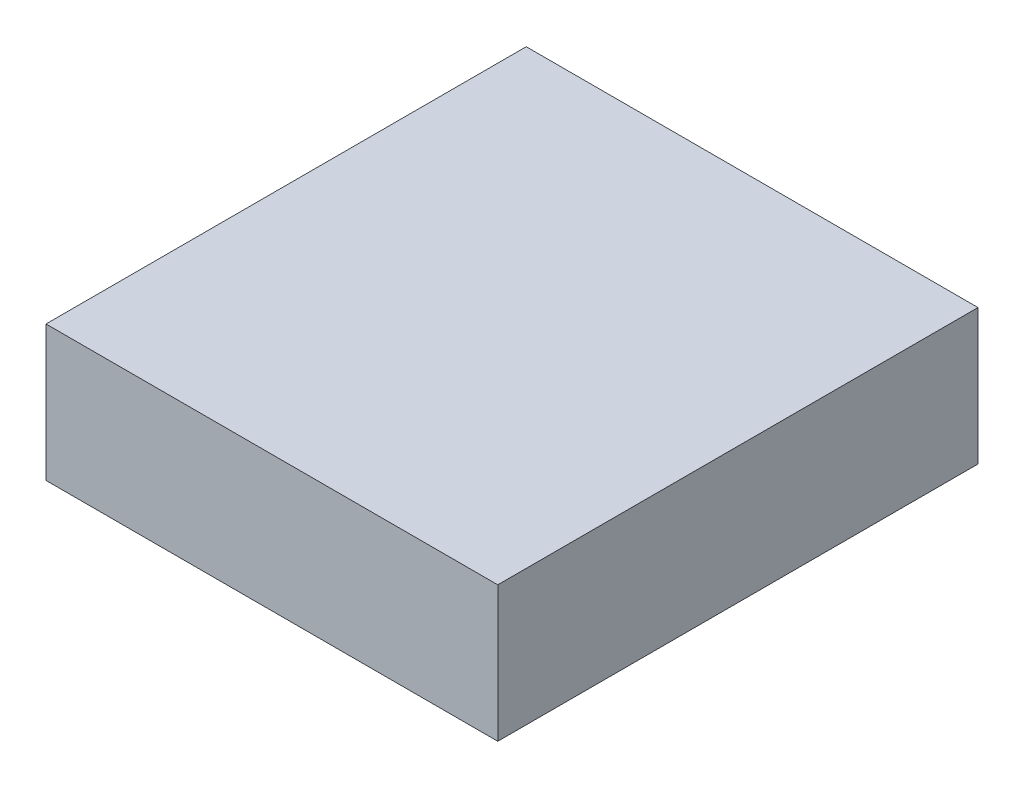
ISO-10303-21;
HEADER;
FILE_DESCRIPTION(('STEP AP214'),'2;1');
FILE_NAME('part.step','',(''),(''),'','','');
FILE_SCHEMA(('AUTOMOTIVE_DESIGN { 1 0 10303 214 1 1 1 1 }'));
ENDSEC;
DATA;
#1=APPLICATION_CONTEXT('core data for automotive mechanical design processes');
#2=APPLICATION_PROTOCOL_DEFINITION('international standard','automotive_design',2000,#1);
#3=PRODUCT_CONTEXT('',#1,'mechanical');
#4=PRODUCT('Part','Part','',(#3));
#5=PRODUCT_RELATED_PRODUCT_CATEGORY('part','',(#4));
#6=PRODUCT_DEFINITION_FORMATION('','',#4);
#7=PRODUCT_DEFINITION_CONTEXT('part definition',#1,'design');
#8=PRODUCT_DEFINITION('design','',#6,#7);
#9=PRODUCT_DEFINITION_SHAPE('','',#8);
#10=(LENGTH_UNIT() NAMED_UNIT(*) SI_UNIT(.MILLI.,.METRE.));
#11=(NAMED_UNIT(*) PLANE_ANGLE_UNIT() SI_UNIT($,.RADIAN.));
#12=(NAMED_UNIT(*) SI_UNIT($,.STERADIAN.) SOLID_ANGLE_UNIT());
#13=UNCERTAINTY_MEASURE_WITH_UNIT(LENGTH_MEASURE(1.E-05),#10,'distance_accuracy_value','');
#14=(GEOMETRIC_REPRESENTATION_CONTEXT(3) GLOBAL_UNCERTAINTY_ASSIGNED_CONTEXT((#13)) GLOBAL_UNIT_ASSIGNED_CONTEXT((#10,
#11,#12)) REPRESENTATION_CONTEXT('',''));
#15=CARTESIAN_POINT('',(0.,0.,0.));
#16=DIRECTION('',(0.,0.,1.));
#17=DIRECTION('',(1.,0.,0.));
#18=AXIS2_PLACEMENT_3D('',#15,#16,#17);
#19=CARTESIAN_POINT('',(0.,0.,1.34999984));
#20=DIRECTION('',(0.,0.,-1.));
#21=DIRECTION('',(0.,-1.,0.));
#22=AXIS2_PLACEMENT_3D('',#19,#20,#21);
#23=PLANE('',#22);
#24=DIRECTION('',(-1.,0.,0.));
#25=VECTOR('',#24,1.);
#26=CARTESIAN_POINT('',(0.635,-0.1905,1.34999984));
#27=LINE('',#26,#25);
#28=CARTESIAN_POINT('',(0.635,-0.1905,1.34999984));
#29=VERTEX_POINT('',#28);
#30=CARTESIAN_POINT('',(-0.635,-0.1905,1.34999984));
#31=VERTEX_POINT('',#30);
#32=EDGE_CURVE('E27',#29,#31,#27,.T.);
#33=ORIENTED_EDGE('',*,*,#32,.F.);
#34=DIRECTION('',(0.,-1.,0.));
#35=VECTOR('',#34,1.);
#36=CARTESIAN_POINT('',(0.635,0.1905,1.34999984));
#37=LINE('',#36,#35);
#38=CARTESIAN_POINT('',(0.635,0.1905,1.34999984));
#39=VERTEX_POINT('',#38);
#40=EDGE_CURVE('E84',#39,#29,#37,.T.);
#41=ORIENTED_EDGE('',*,*,#40,.F.);
#42=DIRECTION('',(1.,0.,0.));
#43=VECTOR('',#42,1.);
#44=CARTESIAN_POINT('',(-0.635,0.1905,1.34999984));
#45=LINE('',#44,#43);
#46=CARTESIAN_POINT('',(-0.635,0.1905,1.34999984));
#47=VERTEX_POINT('',#46);
#48=EDGE_CURVE('E87',#47,#39,#45,.T.);
#49=ORIENTED_EDGE('',*,*,#48,.F.);
#50=DIRECTION('',(0.,1.,0.));
#51=VECTOR('',#50,1.);
#52=CARTESIAN_POINT('',(-0.635,-0.1905,1.34999984));
#53=LINE('',#52,#51);
#54=EDGE_CURVE('E111',#31,#47,#53,.T.);
#55=ORIENTED_EDGE('',*,*,#54,.F.);
#56=EDGE_LOOP('',(#33,#41,#49,#55));
#57=FACE_BOUND('',#56,.T.);
#58=ADVANCED_FACE('F17',(#57),#23,.F.);
#59=CARTESIAN_POINT('',(0.,0.,0.));
#60=DIRECTION('',(0.,0.,-1.));
#61=DIRECTION('',(0.,-1.,0.));
#62=AXIS2_PLACEMENT_3D('',#59,#60,#61);
#63=PLANE('',#62);
#64=DIRECTION('',(0.,1.,0.));
#65=VECTOR('',#64,1.);
#66=CARTESIAN_POINT('',(-0.635,-0.1905,0.));
#67=LINE('',#66,#65);
#68=CARTESIAN_POINT('',(-0.635,-0.1905,0.));
#69=VERTEX_POINT('',#68);
#70=CARTESIAN_POINT('',(-0.635,0.1905,0.));
#71=VERTEX_POINT('',#70);
#72=EDGE_CURVE('E79',#69,#71,#67,.T.);
#73=ORIENTED_EDGE('',*,*,#72,.T.);
#74=DIRECTION('',(1.,0.,0.));
#75=VECTOR('',#74,1.);
#76=CARTESIAN_POINT('',(-0.635,0.1905,0.));
#77=LINE('',#76,#75);
#78=CARTESIAN_POINT('',(0.635,0.1905,0.));
#79=VERTEX_POINT('',#78);
#80=EDGE_CURVE('E76',#71,#79,#77,.T.);
#81=ORIENTED_EDGE('',*,*,#80,.T.);
#82=DIRECTION('',(0.,-1.,0.));
#83=VECTOR('',#82,1.);
#84=CARTESIAN_POINT('',(0.635,0.1905,0.));
#85=LINE('',#84,#83);
#86=CARTESIAN_POINT('',(0.635,-0.1905,0.));
#87=VERTEX_POINT('',#86);
#88=EDGE_CURVE('E20',#79,#87,#85,.T.);
#89=ORIENTED_EDGE('',*,*,#88,.T.);
#90=DIRECTION('',(-1.,0.,0.));
#91=VECTOR('',#90,1.);
#92=CARTESIAN_POINT('',(0.635,-0.1905,0.));
#93=LINE('',#92,#91);
#94=EDGE_CURVE('E11',#87,#69,#93,.T.);
#95=ORIENTED_EDGE('',*,*,#94,.T.);
#96=EDGE_LOOP('',(#73,#81,#89,#95));
#97=FACE_BOUND('',#96,.T.);
#98=ADVANCED_FACE('F77',(#97),#63,.T.);
#99=CARTESIAN_POINT('',(0.635,-0.1905,0.));
#100=DIRECTION('',(0.,-1.,0.));
#101=DIRECTION('',(0.,0.,-1.));
#102=AXIS2_PLACEMENT_3D('',#99,#100,#101);
#103=PLANE('',#102);
#104=DIRECTION('',(0.,0.,1.));
#105=VECTOR('',#104,1.);
#106=CARTESIAN_POINT('',(0.635,-0.1905,0.));
#107=LINE('',#106,#105);
#108=EDGE_CURVE('E72',#87,#29,#107,.T.);
#109=ORIENTED_EDGE('',*,*,#108,.T.);
#110=ORIENTED_EDGE('',*,*,#32,.T.);
#111=DIRECTION('',(0.,0.,1.));
#112=VECTOR('',#111,1.);
#113=CARTESIAN_POINT('',(-0.635,-0.1905,0.));
#114=LINE('',#113,#112);
#115=EDGE_CURVE('E108',#69,#31,#114,.T.);
#116=ORIENTED_EDGE('',*,*,#115,.F.);
#117=ORIENTED_EDGE('',*,*,#94,.F.);
#118=EDGE_LOOP('',(#109,#110,#116,#117));
#119=FACE_BOUND('',#118,.T.);
#120=ADVANCED_FACE('F105',(#119),#103,.T.);
#121=CARTESIAN_POINT('',(0.635,0.1905,0.));
#122=DIRECTION('',(1.,0.,0.));
#123=DIRECTION('',(0.,1.,0.));
#124=AXIS2_PLACEMENT_3D('',#121,#122,#123);
#125=PLANE('',#124);
#126=DIRECTION('',(0.,0.,1.));
#127=VECTOR('',#126,1.);
#128=CARTESIAN_POINT('',(0.635,0.1905,0.));
#129=LINE('',#128,#127);
#130=EDGE_CURVE('E70',#79,#39,#129,.T.);
#131=ORIENTED_EDGE('',*,*,#130,.T.);
#132=ORIENTED_EDGE('',*,*,#40,.T.);
#133=ORIENTED_EDGE('',*,*,#108,.F.);
#134=ORIENTED_EDGE('',*,*,#88,.F.);
#135=EDGE_LOOP('',(#131,#132,#133,#134));
#136=FACE_BOUND('',#135,.T.);
#137=ADVANCED_FACE('F67',(#136),#125,.T.);
#138=CARTESIAN_POINT('',(-0.635,0.1905,0.));
#139=DIRECTION('',(0.,1.,0.));
#140=DIRECTION('',(1.,0.,0.));
#141=AXIS2_PLACEMENT_3D('',#138,#139,#140);
#142=PLANE('',#141);
#143=DIRECTION('',(0.,0.,1.));
#144=VECTOR('',#143,1.);
#145=CARTESIAN_POINT('',(-0.635,0.1905,0.));
#146=LINE('',#145,#144);
#147=EDGE_CURVE('E114',#71,#47,#146,.T.);
#148=ORIENTED_EDGE('',*,*,#147,.T.);
#149=ORIENTED_EDGE('',*,*,#48,.T.);
#150=ORIENTED_EDGE('',*,*,#130,.F.);
#151=ORIENTED_EDGE('',*,*,#80,.F.);
#152=EDGE_LOOP('',(#148,#149,#150,#151));
#153=FACE_BOUND('',#152,.T.);
#154=ADVANCED_FACE('F86',(#153),#142,.T.);
#155=CARTESIAN_POINT('',(-0.635,-0.1905,0.));
#156=DIRECTION('',(-1.,0.,0.));
#157=DIRECTION('',(0.,0.,1.));
#158=AXIS2_PLACEMENT_3D('',#155,#156,#157);
#159=PLANE('',#158);
#160=ORIENTED_EDGE('',*,*,#115,.T.);
#161=ORIENTED_EDGE('',*,*,#54,.T.);
#162=ORIENTED_EDGE('',*,*,#147,.F.);
#163=ORIENTED_EDGE('',*,*,#72,.F.);
#164=EDGE_LOOP('',(#160,#161,#162,#163));
#165=FACE_BOUND('',#164,.T.);
#166=ADVANCED_FACE('F116',(#165),#159,.T.);
#167=CLOSED_SHELL('',(#58,#98,#120,#137,#154,#166));
#168=MANIFOLD_SOLID_BREP('B1',#167);
#169=ADVANCED_BREP_SHAPE_REPRESENTATION('',(#18,#168),#14);
#170=SHAPE_DEFINITION_REPRESENTATION(#9,#169);
ENDSEC;
END-ISO-10303-21;
